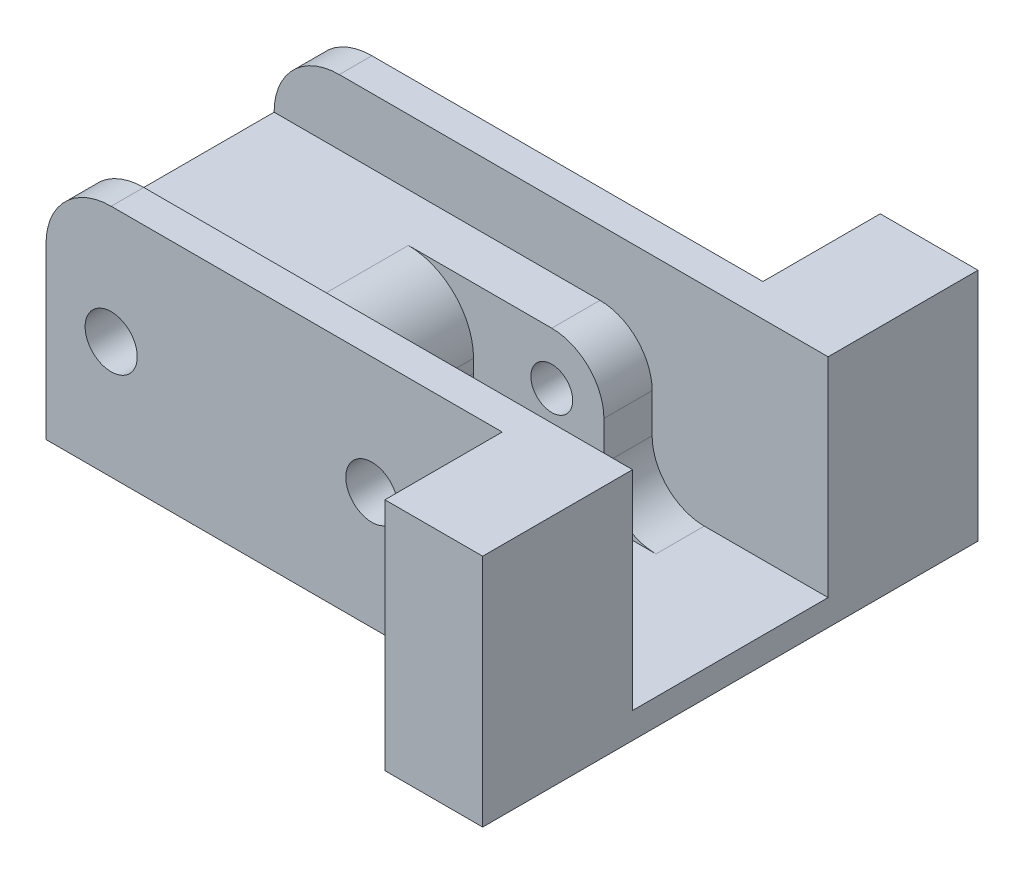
from build123d import *

# Parameters (mm, degrees)
SKETCH_1_R          = 1.605
EXTRUDE_1_DEPTH     = 10
SKETCH_2_W          = 10
SKETCH_2_H          = 7.6
CUT_EXTRUDE_1_DEPTH = 11
FILLET_1_R          = 5
SKETCH_6_W          = 13.5
SKETCH_6_H          = 2.5
EXTRUDE_4_DEPTH     = 11
SKETCH_7_W          = 7.5
SKETCH_7_H          = 9
EXTRUDE_5_DEPTH     = 13
FILLET_3_R          = 4
EXTRUDE_6_DEPTH     = 5
FILLET_5_R          = 5
SKETCH_11_R         = 2
CUT_EXTRUDE_3_DEPTH = 5
CUT_EXTRUDE_START   = -5
SKETCH_12_R         = 2
CUT_EXTRUDE_4_DEPTH = 5


with BuildPart() as part:
    # Sketch 1 → Extrude 1 (new, symmetric)
    with BuildSketch(Plane.XY):
        Polygon((-5, 4), (24, 4), (24, -7), (37.5, -7), (37.5, -9), (-5, -9), align=None)
        Circle(SKETCH_1_R, mode=Mode.SUBTRACT)
        with Locations((20, 0)):
            Circle(SKETCH_1_R, mode=Mode.SUBTRACT)
    extrude(amount=EXTRUDE_1_DEPTH, both=True)

    # Sketch 2 → Cut-Extrude 1 (cut)
    with BuildSketch(Plane(origin=(0, 4, 0), x_dir=(1, 0, 0), z_dir=(0, 1, 0))):
        with Locations((19, 0)):
            Rectangle(SKETCH_2_W, SKETCH_2_H)
    extrude(amount=-CUT_EXTRUDE_1_DEPTH, mode=Mode.SUBTRACT)

    # Fillet 1
    fillet_1_edges = [part.edges().sort_by_distance(p)[0] for p in [
        (14, -7, 0),
        (14, 4, 0),
    ]]
    fillet(fillet_1_edges, radius=FILLET_1_R)

    # Sketch 6 → Extrude 4 (add)
    with BuildSketch(Plane(origin=(0, -7, 0), x_dir=(1, 0, 0), z_dir=(0, 1, 0))):
        with Locations((30.75, 8.75)):
            Rectangle(SKETCH_6_W, SKETCH_6_H)
        with Locations((30.75, -8.75)):
            Rectangle(SKETCH_6_W, SKETCH_6_H)
    extrude(amount=EXTRUDE_4_DEPTH)

    # Sketch 7 → Extrude 5 (add)
    with BuildSketch(Plane(origin=(0, 4, 0), x_dir=(1, 0, 0), z_dir=(0, 1, 0))):
        with Locations((33.75, 14.5)):
            Rectangle(SKETCH_7_W, SKETCH_7_H)
        with Locations((33.75, -14.5)):
            Rectangle(SKETCH_7_W, SKETCH_7_H)
    extrude(amount=-EXTRUDE_5_DEPTH)

    # Fillet 3
    fillet_3_edges = [part.edges().sort_by_distance(p)[0] for p in [
        (24, 4, -5.65),
        (24, -7, -5.65),
        (24, 4, 5.65),
        (24, -7, 5.65),
    ]]
    fillet(fillet_3_edges, radius=FILLET_3_R)

    # Sketch 8 → Extrude 6 (add)
    with BuildSketch(Plane(origin=(0, 4, 0), x_dir=(1, 0, 0), z_dir=(0, 1, 0))):
        Polygon((37.5, -7.5), (-5, -7.5), (-5, -10), (30, -10), (30, -19), (37.5, -19), align=None)
        Polygon((-5, 10), (30, 10), (30, 19), (37.5, 19), (37.5, 7.5), (-5, 7.5), align=None)
    extrude(amount=EXTRUDE_6_DEPTH)

    # Fillet 5
    fillet_5_edges = [part.edges().sort_by_distance(p)[0] for p in [
        (-5, 9, 8.75),
        (-5, 9, -8.75),
    ]]
    fillet(fillet_5_edges, radius=FILLET_5_R)

    # Sketch 11 → Cut-Extrude 3 (cut)
    with BuildSketch(Plane.XY.offset(10)):
        Circle(SKETCH_11_R)
        with Locations((20, 0)):
            Circle(SKETCH_11_R)
    extrude(amount=-CUT_EXTRUDE_3_DEPTH, mode=Mode.SUBTRACT)

    # Sketch 12 → Cut-Extrude 4 (cut)
    with BuildSketch(Plane(origin=(0, 0, -10), x_dir=(-1, 0, 0), z_dir=(0, 0, -1)).offset(CUT_EXTRUDE_START)):
        with Locations(Location((0, 0, 0), (0, 0, 180))):
            Circle(SKETCH_12_R)
    extrude(amount=CUT_EXTRUDE_4_DEPTH, mode=Mode.SUBTRACT)


solid = part.part
